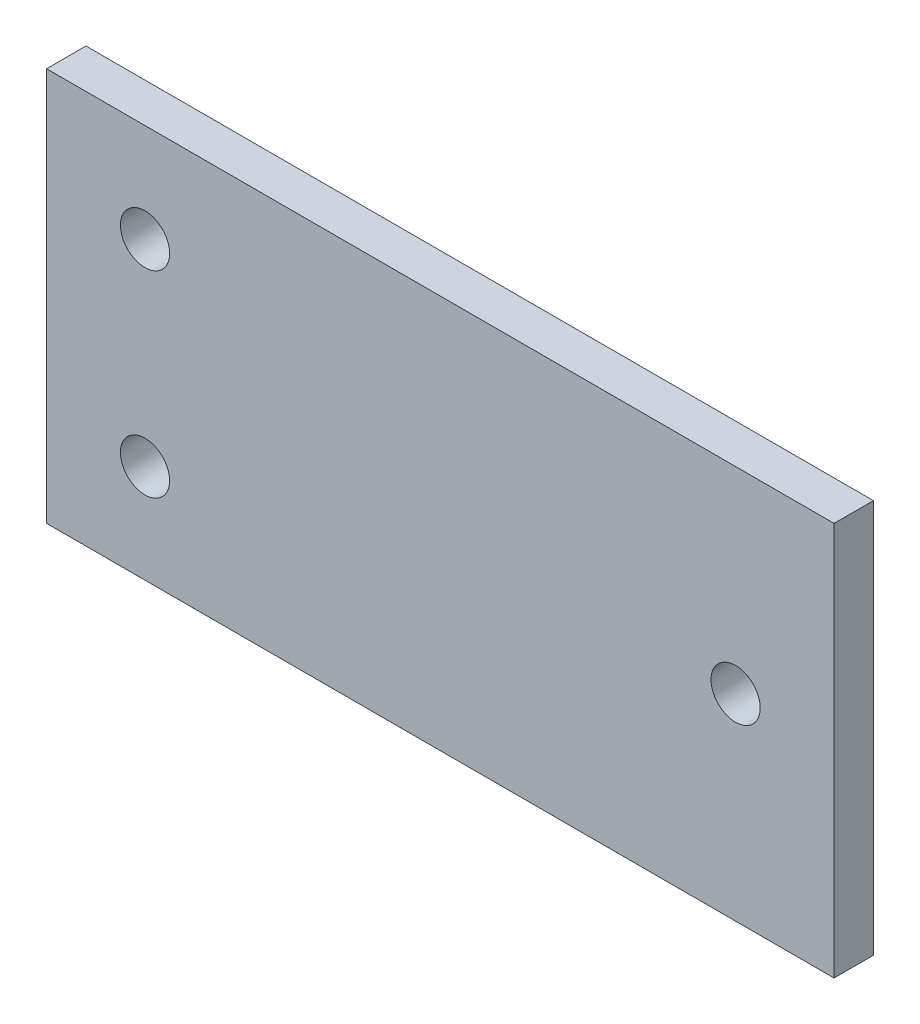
from build123d import *

# Parameters (mm, degrees)
SCHIZZO1_W                   = 160
SCHIZZO1_H                   = 80
SCHIZZO1_R                   = 5
ESTRUSIONE_ESTRUSIONE1_DEPTH = 8
FORO_10_0_10_1_D             = 10
FORO_10_0_10_1_DEPTH         = 8


with BuildPart() as part:
    # Schizzo1 → Estrusione-Estrusione1 (new body)
    with BuildSketch(Plane.XY):
        with Locations((80, 40)):
            Rectangle(SCHIZZO1_W, SCHIZZO1_H)
        with Locations((20, 60)):
            Circle(SCHIZZO1_R, mode=Mode.SUBTRACT)
        with Locations((20, 20)):
            Circle(SCHIZZO1_R, mode=Mode.SUBTRACT)
    extrude(amount=ESTRUSIONE_ESTRUSIONE1_DEPTH)

    # Foro _10.0 _10_-1
    with Locations(Plane(origin=(0, 0, 0), x_dir=(-1, 0, 0), z_dir=(0, 0, -1))):
        with Locations((-140, 40), (-124.364161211, 89.676724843)):
            Hole(FORO_10_0_10_1_D / 2, depth=FORO_10_0_10_1_DEPTH)


solid = part.part
